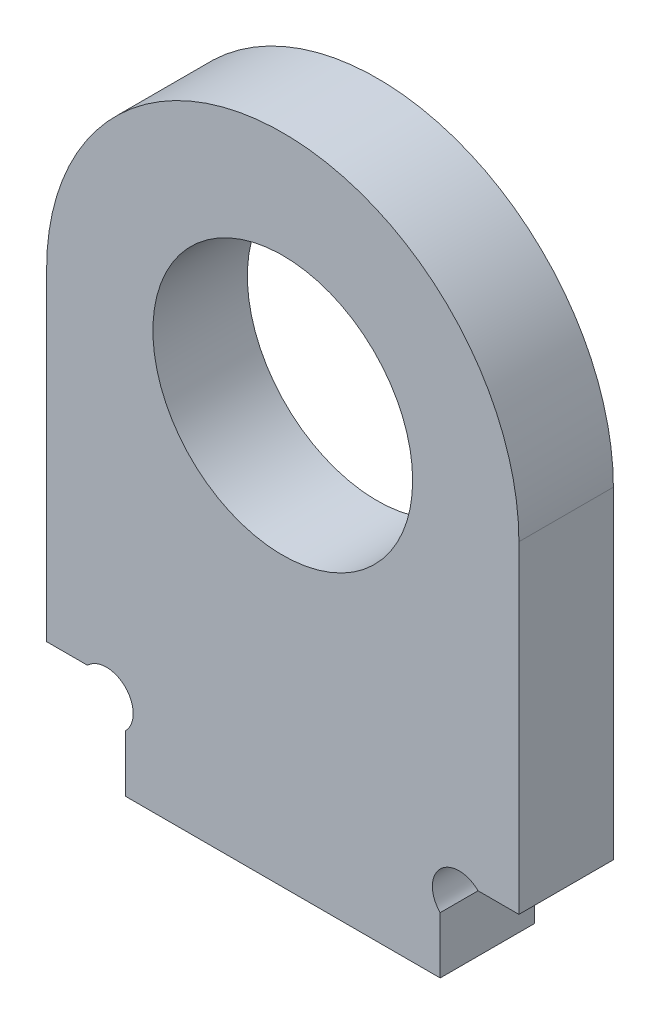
ISO-10303-21;
HEADER;
FILE_DESCRIPTION(('STEP AP214'),'2;1');
FILE_NAME('part.step','',(''),(''),'','','');
FILE_SCHEMA(('AUTOMOTIVE_DESIGN { 1 0 10303 214 1 1 1 1 }'));
ENDSEC;
DATA;
#1=APPLICATION_CONTEXT('core data for automotive mechanical design processes');
#2=APPLICATION_PROTOCOL_DEFINITION('international standard','automotive_design',2000,#1);
#3=PRODUCT_CONTEXT('',#1,'mechanical');
#4=PRODUCT('Part','Part','',(#3));
#5=PRODUCT_RELATED_PRODUCT_CATEGORY('part','',(#4));
#6=PRODUCT_DEFINITION_FORMATION('','',#4);
#7=PRODUCT_DEFINITION_CONTEXT('part definition',#1,'design');
#8=PRODUCT_DEFINITION('design','',#6,#7);
#9=PRODUCT_DEFINITION_SHAPE('','',#8);
#10=(LENGTH_UNIT() NAMED_UNIT(*) SI_UNIT(.MILLI.,.METRE.));
#11=(NAMED_UNIT(*) PLANE_ANGLE_UNIT() SI_UNIT($,.RADIAN.));
#12=(NAMED_UNIT(*) SI_UNIT($,.STERADIAN.) SOLID_ANGLE_UNIT());
#13=UNCERTAINTY_MEASURE_WITH_UNIT(LENGTH_MEASURE(1.E-05),#10,'distance_accuracy_value','');
#14=(GEOMETRIC_REPRESENTATION_CONTEXT(3) GLOBAL_UNCERTAINTY_ASSIGNED_CONTEXT((#13)) GLOBAL_UNIT_ASSIGNED_CONTEXT((#10,
#11,#12)) REPRESENTATION_CONTEXT('',''));
#15=CARTESIAN_POINT('',(0.,0.,0.));
#16=DIRECTION('',(0.,0.,1.));
#17=DIRECTION('',(1.,0.,0.));
#18=AXIS2_PLACEMENT_3D('',#15,#16,#17);
#19=CARTESIAN_POINT('',(15.,26.5,6.));
#20=DIRECTION('',(0.,0.,1.));
#21=DIRECTION('',(1.,0.,0.));
#22=AXIS2_PLACEMENT_3D('',#19,#20,#21);
#23=PLANE('',#22);
#24=CARTESIAN_POINT('',(15.,26.5,6.));
#25=DIRECTION('',(0.,0.,1.));
#26=DIRECTION('',(1.,0.,0.));
#27=AXIS2_PLACEMENT_3D('',#24,#25,#26);
#28=CIRCLE('',#27,15.);
#29=CARTESIAN_POINT('',(30.,26.5,6.));
#30=VERTEX_POINT('',#29);
#31=CARTESIAN_POINT('',(0.,26.5,6.));
#32=VERTEX_POINT('',#31);
#33=EDGE_CURVE('E144',#30,#32,#28,.T.);
#34=ORIENTED_EDGE('',*,*,#33,.T.);
#35=DIRECTION('',(0.,-1.,0.));
#36=VECTOR('',#35,1.);
#37=CARTESIAN_POINT('',(0.,26.5,6.));
#38=LINE('',#37,#36);
#39=CARTESIAN_POINT('',(0.,6.,6.));
#40=VERTEX_POINT('',#39);
#41=EDGE_CURVE('E117',#32,#40,#38,.T.);
#42=ORIENTED_EDGE('',*,*,#41,.T.);
#43=DIRECTION('',(1.,0.,0.));
#44=VECTOR('',#43,1.);
#45=CARTESIAN_POINT('',(0.,6.,6.));
#46=LINE('',#45,#44);
#47=CARTESIAN_POINT('',(2.59583694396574,6.,6.));
#48=VERTEX_POINT('',#47);
#49=EDGE_CURVE('E147',#40,#48,#46,.T.);
#50=ORIENTED_EDGE('',*,*,#49,.T.);
#51=CARTESIAN_POINT('',(3.79791847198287,4.79791847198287,6.));
#52=DIRECTION('',(0.,0.,-1.));
#53=DIRECTION('',(1.,0.,0.));
#54=AXIS2_PLACEMENT_3D('',#51,#52,#53);
#55=CIRCLE('',#54,1.7);
#56=CARTESIAN_POINT('',(5.,3.59583694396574,6.));
#57=VERTEX_POINT('',#56);
#58=EDGE_CURVE('E149',#48,#57,#55,.T.);
#59=ORIENTED_EDGE('',*,*,#58,.T.);
#60=DIRECTION('',(0.,-1.,0.));
#61=VECTOR('',#60,1.);
#62=CARTESIAN_POINT('',(5.,3.59583694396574,6.));
#63=LINE('',#62,#61);
#64=CARTESIAN_POINT('',(5.,0.,6.));
#65=VERTEX_POINT('',#64);
#66=EDGE_CURVE('E151',#57,#65,#63,.T.);
#67=ORIENTED_EDGE('',*,*,#66,.T.);
#68=DIRECTION('',(1.,0.,0.));
#69=VECTOR('',#68,1.);
#70=CARTESIAN_POINT('',(5.,0.,6.));
#71=LINE('',#70,#69);
#72=CARTESIAN_POINT('',(25.,0.,6.));
#73=VERTEX_POINT('',#72);
#74=EDGE_CURVE('E153',#65,#73,#71,.T.);
#75=ORIENTED_EDGE('',*,*,#74,.T.);
#76=DIRECTION('',(0.,1.,0.));
#77=VECTOR('',#76,1.);
#78=CARTESIAN_POINT('',(25.,0.,6.));
#79=LINE('',#78,#77);
#80=CARTESIAN_POINT('',(25.,3.59583694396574,6.));
#81=VERTEX_POINT('',#80);
#82=EDGE_CURVE('E155',#73,#81,#79,.T.);
#83=ORIENTED_EDGE('',*,*,#82,.T.);
#84=CARTESIAN_POINT('',(26.2020815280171,4.79791847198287,6.));
#85=DIRECTION('',(0.,0.,-1.));
#86=DIRECTION('',(-1.,0.,0.));
#87=AXIS2_PLACEMENT_3D('',#84,#85,#86);
#88=CIRCLE('',#87,1.7);
#89=CARTESIAN_POINT('',(27.4041630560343,6.,6.));
#90=VERTEX_POINT('',#89);
#91=EDGE_CURVE('E157',#81,#90,#88,.T.);
#92=ORIENTED_EDGE('',*,*,#91,.T.);
#93=DIRECTION('',(1.,0.,0.));
#94=VECTOR('',#93,1.);
#95=CARTESIAN_POINT('',(27.4041630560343,6.,6.));
#96=LINE('',#95,#94);
#97=CARTESIAN_POINT('',(30.,6.,6.));
#98=VERTEX_POINT('',#97);
#99=EDGE_CURVE('E46',#90,#98,#96,.T.);
#100=ORIENTED_EDGE('',*,*,#99,.T.);
#101=DIRECTION('',(0.,1.,0.));
#102=VECTOR('',#101,1.);
#103=CARTESIAN_POINT('',(30.,6.,6.));
#104=LINE('',#103,#102);
#105=EDGE_CURVE('E41',#98,#30,#104,.T.);
#106=ORIENTED_EDGE('',*,*,#105,.T.);
#107=EDGE_LOOP('',(#34,#42,#50,#59,#67,#75,#83,#92,#100,#106));
#108=FACE_BOUND('',#107,.T.);
#109=CARTESIAN_POINT('',(15.,26.5,6.));
#110=DIRECTION('',(0.,0.,1.));
#111=DIRECTION('',(1.,0.,0.));
#112=AXIS2_PLACEMENT_3D('',#109,#110,#111);
#113=CIRCLE('',#112,8.25);
#114=CARTESIAN_POINT('',(23.25,26.5,6.));
#115=VERTEX_POINT('',#114);
#116=EDGE_CURVE('E122',#115,#115,#113,.T.);
#117=ORIENTED_EDGE('',*,*,#116,.F.);
#118=EDGE_LOOP('',(#117));
#119=FACE_BOUND('',#118,.T.);
#120=ADVANCED_FACE('F26',(#108,#119),#23,.T.);
#121=CARTESIAN_POINT('',(15.,26.5,0.));
#122=DIRECTION('',(0.,0.,1.));
#123=DIRECTION('',(1.,0.,0.));
#124=AXIS2_PLACEMENT_3D('',#121,#122,#123);
#125=PLANE('',#124);
#126=CARTESIAN_POINT('',(15.,26.5,0.));
#127=DIRECTION('',(0.,0.,1.));
#128=DIRECTION('',(1.,0.,0.));
#129=AXIS2_PLACEMENT_3D('',#126,#127,#128);
#130=CIRCLE('',#129,15.);
#131=CARTESIAN_POINT('',(30.,26.5,0.));
#132=VERTEX_POINT('',#131);
#133=CARTESIAN_POINT('',(0.,26.5,0.));
#134=VERTEX_POINT('',#133);
#135=EDGE_CURVE('E108',#132,#134,#130,.T.);
#136=ORIENTED_EDGE('',*,*,#135,.F.);
#137=DIRECTION('',(0.,1.,0.));
#138=VECTOR('',#137,1.);
#139=CARTESIAN_POINT('',(30.,6.,0.));
#140=LINE('',#139,#138);
#141=CARTESIAN_POINT('',(30.,6.,0.));
#142=VERTEX_POINT('',#141);
#143=EDGE_CURVE('E142',#142,#132,#140,.T.);
#144=ORIENTED_EDGE('',*,*,#143,.F.);
#145=DIRECTION('',(1.,0.,0.));
#146=VECTOR('',#145,1.);
#147=CARTESIAN_POINT('',(27.4041630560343,6.,0.));
#148=LINE('',#147,#146);
#149=CARTESIAN_POINT('',(27.4041630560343,6.,0.));
#150=VERTEX_POINT('',#149);
#151=EDGE_CURVE('E140',#150,#142,#148,.T.);
#152=ORIENTED_EDGE('',*,*,#151,.F.);
#153=CARTESIAN_POINT('',(26.2020815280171,4.79791847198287,0.));
#154=DIRECTION('',(0.,0.,-1.));
#155=DIRECTION('',(-1.,0.,0.));
#156=AXIS2_PLACEMENT_3D('',#153,#154,#155);
#157=CIRCLE('',#156,1.7);
#158=CARTESIAN_POINT('',(25.,3.59583694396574,0.));
#159=VERTEX_POINT('',#158);
#160=EDGE_CURVE('E138',#159,#150,#157,.T.);
#161=ORIENTED_EDGE('',*,*,#160,.F.);
#162=DIRECTION('',(0.,1.,0.));
#163=VECTOR('',#162,1.);
#164=CARTESIAN_POINT('',(25.,0.,0.));
#165=LINE('',#164,#163);
#166=CARTESIAN_POINT('',(25.,0.,0.));
#167=VERTEX_POINT('',#166);
#168=EDGE_CURVE('E136',#167,#159,#165,.T.);
#169=ORIENTED_EDGE('',*,*,#168,.F.);
#170=DIRECTION('',(1.,0.,0.));
#171=VECTOR('',#170,1.);
#172=CARTESIAN_POINT('',(5.,0.,0.));
#173=LINE('',#172,#171);
#174=CARTESIAN_POINT('',(5.,0.,0.));
#175=VERTEX_POINT('',#174);
#176=EDGE_CURVE('E134',#175,#167,#173,.T.);
#177=ORIENTED_EDGE('',*,*,#176,.F.);
#178=DIRECTION('',(0.,-1.,0.));
#179=VECTOR('',#178,1.);
#180=CARTESIAN_POINT('',(5.,3.59583694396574,0.));
#181=LINE('',#180,#179);
#182=CARTESIAN_POINT('',(5.,3.59583694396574,0.));
#183=VERTEX_POINT('',#182);
#184=EDGE_CURVE('E132',#183,#175,#181,.T.);
#185=ORIENTED_EDGE('',*,*,#184,.F.);
#186=CARTESIAN_POINT('',(3.79791847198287,4.79791847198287,0.));
#187=DIRECTION('',(0.,0.,-1.));
#188=DIRECTION('',(1.,0.,0.));
#189=AXIS2_PLACEMENT_3D('',#186,#187,#188);
#190=CIRCLE('',#189,1.7);
#191=CARTESIAN_POINT('',(2.59583694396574,6.,0.));
#192=VERTEX_POINT('',#191);
#193=EDGE_CURVE('E130',#192,#183,#190,.T.);
#194=ORIENTED_EDGE('',*,*,#193,.F.);
#195=DIRECTION('',(1.,0.,0.));
#196=VECTOR('',#195,1.);
#197=CARTESIAN_POINT('',(0.,6.,0.));
#198=LINE('',#197,#196);
#199=CARTESIAN_POINT('',(0.,6.,0.));
#200=VERTEX_POINT('',#199);
#201=EDGE_CURVE('E110',#200,#192,#198,.T.);
#202=ORIENTED_EDGE('',*,*,#201,.F.);
#203=DIRECTION('',(0.,-1.,0.));
#204=VECTOR('',#203,1.);
#205=CARTESIAN_POINT('',(0.,26.5,0.));
#206=LINE('',#205,#204);
#207=EDGE_CURVE('E103',#134,#200,#206,.T.);
#208=ORIENTED_EDGE('',*,*,#207,.F.);
#209=EDGE_LOOP('',(#136,#144,#152,#161,#169,#177,#185,#194,#202,#208));
#210=FACE_BOUND('',#209,.T.);
#211=CARTESIAN_POINT('',(15.,26.5,0.));
#212=DIRECTION('',(0.,0.,1.));
#213=DIRECTION('',(1.,0.,0.));
#214=AXIS2_PLACEMENT_3D('',#211,#212,#213);
#215=CIRCLE('',#214,8.25);
#216=CARTESIAN_POINT('',(23.25,26.5,0.));
#217=VERTEX_POINT('',#216);
#218=EDGE_CURVE('E125',#217,#217,#215,.T.);
#219=ORIENTED_EDGE('',*,*,#218,.T.);
#220=EDGE_LOOP('',(#219));
#221=FACE_BOUND('',#220,.T.);
#222=ADVANCED_FACE('F104',(#210,#221),#125,.F.);
#223=CARTESIAN_POINT('',(15.,26.5,6.));
#224=DIRECTION('',(0.,0.,-1.));
#225=DIRECTION('',(-1.,0.,0.));
#226=AXIS2_PLACEMENT_3D('',#223,#224,#225);
#227=CYLINDRICAL_SURFACE('',#226,15.);
#228=ORIENTED_EDGE('',*,*,#135,.T.);
#229=DIRECTION('',(0.,0.,-1.));
#230=VECTOR('',#229,1.);
#231=CARTESIAN_POINT('',(0.,26.5,6.));
#232=LINE('',#231,#230);
#233=EDGE_CURVE('E11',#32,#134,#232,.T.);
#234=ORIENTED_EDGE('',*,*,#233,.F.);
#235=ORIENTED_EDGE('',*,*,#33,.F.);
#236=DIRECTION('',(0.,0.,-1.));
#237=VECTOR('',#236,1.);
#238=CARTESIAN_POINT('',(30.,26.5,6.));
#239=LINE('',#238,#237);
#240=EDGE_CURVE('E121',#30,#132,#239,.T.);
#241=ORIENTED_EDGE('',*,*,#240,.T.);
#242=EDGE_LOOP('',(#228,#234,#235,#241));
#243=FACE_BOUND('',#242,.T.);
#244=ADVANCED_FACE('F28',(#243),#227,.T.);
#245=CARTESIAN_POINT('',(0.,26.5,6.));
#246=DIRECTION('',(1.,0.,0.));
#247=DIRECTION('',(0.,0.,-1.));
#248=AXIS2_PLACEMENT_3D('',#245,#246,#247);
#249=PLANE('',#248);
#250=ORIENTED_EDGE('',*,*,#207,.T.);
#251=DIRECTION('',(0.,0.,-1.));
#252=VECTOR('',#251,1.);
#253=CARTESIAN_POINT('',(0.,6.,6.));
#254=LINE('',#253,#252);
#255=EDGE_CURVE('E34',#40,#200,#254,.T.);
#256=ORIENTED_EDGE('',*,*,#255,.F.);
#257=ORIENTED_EDGE('',*,*,#41,.F.);
#258=ORIENTED_EDGE('',*,*,#233,.T.);
#259=EDGE_LOOP('',(#250,#256,#257,#258));
#260=FACE_BOUND('',#259,.T.);
#261=ADVANCED_FACE('F116',(#260),#249,.F.);
#262=CARTESIAN_POINT('',(0.,6.,6.));
#263=DIRECTION('',(0.,1.,0.));
#264=DIRECTION('',(-1.,0.,0.));
#265=AXIS2_PLACEMENT_3D('',#262,#263,#264);
#266=PLANE('',#265);
#267=ORIENTED_EDGE('',*,*,#201,.T.);
#268=DIRECTION('',(0.,0.,-1.));
#269=VECTOR('',#268,1.);
#270=CARTESIAN_POINT('',(2.59583694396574,6.,6.));
#271=LINE('',#270,#269);
#272=EDGE_CURVE('E180',#48,#192,#271,.T.);
#273=ORIENTED_EDGE('',*,*,#272,.F.);
#274=ORIENTED_EDGE('',*,*,#49,.F.);
#275=ORIENTED_EDGE('',*,*,#255,.T.);
#276=EDGE_LOOP('',(#267,#273,#274,#275));
#277=FACE_BOUND('',#276,.T.);
#278=ADVANCED_FACE('F184',(#277),#266,.F.);
#279=CARTESIAN_POINT('',(3.79791847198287,4.79791847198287,6.));
#280=DIRECTION('',(0.,0.,-1.));
#281=DIRECTION('',(-1.,0.,0.));
#282=AXIS2_PLACEMENT_3D('',#279,#280,#281);
#283=CYLINDRICAL_SURFACE('',#282,1.7);
#284=ORIENTED_EDGE('',*,*,#193,.T.);
#285=DIRECTION('',(0.,0.,-1.));
#286=VECTOR('',#285,1.);
#287=CARTESIAN_POINT('',(5.,3.59583694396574,6.));
#288=LINE('',#287,#286);
#289=EDGE_CURVE('E177',#57,#183,#288,.T.);
#290=ORIENTED_EDGE('',*,*,#289,.F.);
#291=ORIENTED_EDGE('',*,*,#58,.F.);
#292=ORIENTED_EDGE('',*,*,#272,.T.);
#293=EDGE_LOOP('',(#284,#290,#291,#292));
#294=FACE_BOUND('',#293,.T.);
#295=ADVANCED_FACE('F192',(#294),#283,.F.);
#296=CARTESIAN_POINT('',(5.,3.59583694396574,6.));
#297=DIRECTION('',(1.,0.,0.));
#298=DIRECTION('',(0.,1.,0.));
#299=AXIS2_PLACEMENT_3D('',#296,#297,#298);
#300=PLANE('',#299);
#301=ORIENTED_EDGE('',*,*,#184,.T.);
#302=DIRECTION('',(0.,0.,-1.));
#303=VECTOR('',#302,1.);
#304=CARTESIAN_POINT('',(5.,0.,6.));
#305=LINE('',#304,#303);
#306=EDGE_CURVE('E174',#65,#175,#305,.T.);
#307=ORIENTED_EDGE('',*,*,#306,.F.);
#308=ORIENTED_EDGE('',*,*,#66,.F.);
#309=ORIENTED_EDGE('',*,*,#289,.T.);
#310=EDGE_LOOP('',(#301,#307,#308,#309));
#311=FACE_BOUND('',#310,.T.);
#312=ADVANCED_FACE('F195',(#311),#300,.F.);
#313=CARTESIAN_POINT('',(5.,0.,6.));
#314=DIRECTION('',(0.,1.,0.));
#315=DIRECTION('',(0.,0.,1.));
#316=AXIS2_PLACEMENT_3D('',#313,#314,#315);
#317=PLANE('',#316);
#318=ORIENTED_EDGE('',*,*,#176,.T.);
#319=DIRECTION('',(0.,0.,-1.));
#320=VECTOR('',#319,1.);
#321=CARTESIAN_POINT('',(25.,0.,6.));
#322=LINE('',#321,#320);
#323=EDGE_CURVE('E171',#73,#167,#322,.T.);
#324=ORIENTED_EDGE('',*,*,#323,.F.);
#325=ORIENTED_EDGE('',*,*,#74,.F.);
#326=ORIENTED_EDGE('',*,*,#306,.T.);
#327=EDGE_LOOP('',(#318,#324,#325,#326));
#328=FACE_BOUND('',#327,.T.);
#329=ADVANCED_FACE('F200',(#328),#317,.F.);
#330=CARTESIAN_POINT('',(25.,0.,6.));
#331=DIRECTION('',(-1.,0.,0.));
#332=DIRECTION('',(0.,0.,1.));
#333=AXIS2_PLACEMENT_3D('',#330,#331,#332);
#334=PLANE('',#333);
#335=ORIENTED_EDGE('',*,*,#168,.T.);
#336=DIRECTION('',(0.,0.,-1.));
#337=VECTOR('',#336,1.);
#338=CARTESIAN_POINT('',(25.,3.59583694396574,6.));
#339=LINE('',#338,#337);
#340=EDGE_CURVE('E168',#81,#159,#339,.T.);
#341=ORIENTED_EDGE('',*,*,#340,.F.);
#342=ORIENTED_EDGE('',*,*,#82,.F.);
#343=ORIENTED_EDGE('',*,*,#323,.T.);
#344=EDGE_LOOP('',(#335,#341,#342,#343));
#345=FACE_BOUND('',#344,.T.);
#346=ADVANCED_FACE('F206',(#345),#334,.F.);
#347=CARTESIAN_POINT('',(26.2020815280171,4.79791847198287,6.));
#348=DIRECTION('',(0.,0.,-1.));
#349=DIRECTION('',(-1.,0.,0.));
#350=AXIS2_PLACEMENT_3D('',#347,#348,#349);
#351=CYLINDRICAL_SURFACE('',#350,1.7);
#352=ORIENTED_EDGE('',*,*,#160,.T.);
#353=DIRECTION('',(0.,0.,-1.));
#354=VECTOR('',#353,1.);
#355=CARTESIAN_POINT('',(27.4041630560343,6.,6.));
#356=LINE('',#355,#354);
#357=EDGE_CURVE('E165',#90,#150,#356,.T.);
#358=ORIENTED_EDGE('',*,*,#357,.F.);
#359=ORIENTED_EDGE('',*,*,#91,.F.);
#360=ORIENTED_EDGE('',*,*,#340,.T.);
#361=EDGE_LOOP('',(#352,#358,#359,#360));
#362=FACE_BOUND('',#361,.T.);
#363=ADVANCED_FACE('F210',(#362),#351,.F.);
#364=CARTESIAN_POINT('',(27.4041630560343,6.,6.));
#365=DIRECTION('',(0.,1.,0.));
#366=DIRECTION('',(-1.,0.,0.));
#367=AXIS2_PLACEMENT_3D('',#364,#365,#366);
#368=PLANE('',#367);
#369=ORIENTED_EDGE('',*,*,#151,.T.);
#370=DIRECTION('',(0.,0.,-1.));
#371=VECTOR('',#370,1.);
#372=CARTESIAN_POINT('',(30.,6.,6.));
#373=LINE('',#372,#371);
#374=EDGE_CURVE('E162',#98,#142,#373,.T.);
#375=ORIENTED_EDGE('',*,*,#374,.F.);
#376=ORIENTED_EDGE('',*,*,#99,.F.);
#377=ORIENTED_EDGE('',*,*,#357,.T.);
#378=EDGE_LOOP('',(#369,#375,#376,#377));
#379=FACE_BOUND('',#378,.T.);
#380=ADVANCED_FACE('F213',(#379),#368,.F.);
#381=CARTESIAN_POINT('',(30.,6.,6.));
#382=DIRECTION('',(-1.,0.,0.));
#383=DIRECTION('',(0.,0.,1.));
#384=AXIS2_PLACEMENT_3D('',#381,#382,#383);
#385=PLANE('',#384);
#386=ORIENTED_EDGE('',*,*,#143,.T.);
#387=ORIENTED_EDGE('',*,*,#240,.F.);
#388=ORIENTED_EDGE('',*,*,#105,.F.);
#389=ORIENTED_EDGE('',*,*,#374,.T.);
#390=EDGE_LOOP('',(#386,#387,#388,#389));
#391=FACE_BOUND('',#390,.T.);
#392=ADVANCED_FACE('F215',(#391),#385,.F.);
#393=CARTESIAN_POINT('',(15.,26.5,6.));
#394=DIRECTION('',(0.,0.,-1.));
#395=DIRECTION('',(-1.,0.,0.));
#396=AXIS2_PLACEMENT_3D('',#393,#394,#395);
#397=CYLINDRICAL_SURFACE('',#396,8.25);
#398=ORIENTED_EDGE('',*,*,#116,.T.);
#399=EDGE_LOOP('',(#398));
#400=FACE_BOUND('',#399,.T.);
#401=ORIENTED_EDGE('',*,*,#218,.F.);
#402=EDGE_LOOP('',(#401));
#403=FACE_BOUND('',#402,.T.);
#404=ADVANCED_FACE('F217',(#400,#403),#397,.F.);
#405=CLOSED_SHELL('',(#120,#222,#244,#261,#278,#295,#312,#329,#346,#363,#380,#392,#404));
#406=MANIFOLD_SOLID_BREP('B2',#405);
#407=ADVANCED_BREP_SHAPE_REPRESENTATION('',(#18,#406),#14);
#408=SHAPE_DEFINITION_REPRESENTATION(#9,#407);
ENDSEC;
END-ISO-10303-21;
